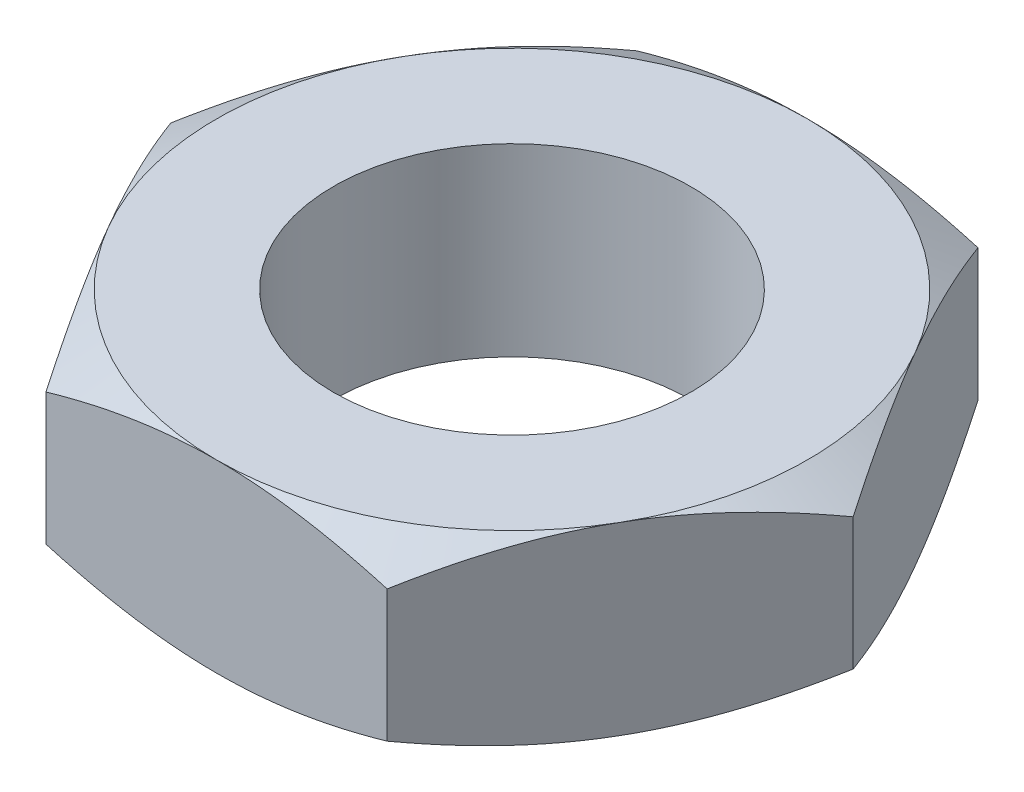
ISO-10303-21;
HEADER;
FILE_DESCRIPTION(('STEP AP214'),'2;1');
FILE_NAME('part.step','',(''),(''),'','','');
FILE_SCHEMA(('AUTOMOTIVE_DESIGN { 1 0 10303 214 1 1 1 1 }'));
ENDSEC;
DATA;
#1=APPLICATION_CONTEXT('core data for automotive mechanical design processes');
#2=APPLICATION_PROTOCOL_DEFINITION('international standard','automotive_design',2000,#1);
#3=PRODUCT_CONTEXT('',#1,'mechanical');
#4=PRODUCT('Part','Part','',(#3));
#5=PRODUCT_RELATED_PRODUCT_CATEGORY('part','',(#4));
#6=PRODUCT_DEFINITION_FORMATION('','',#4);
#7=PRODUCT_DEFINITION_CONTEXT('part definition',#1,'design');
#8=PRODUCT_DEFINITION('design','',#6,#7);
#9=PRODUCT_DEFINITION_SHAPE('','',#8);
#10=(LENGTH_UNIT() NAMED_UNIT(*) SI_UNIT(.MILLI.,.METRE.));
#11=(NAMED_UNIT(*) PLANE_ANGLE_UNIT() SI_UNIT($,.RADIAN.));
#12=(NAMED_UNIT(*) SI_UNIT($,.STERADIAN.) SOLID_ANGLE_UNIT());
#13=UNCERTAINTY_MEASURE_WITH_UNIT(LENGTH_MEASURE(1.E-05),#10,'distance_accuracy_value','');
#14=(GEOMETRIC_REPRESENTATION_CONTEXT(3) GLOBAL_UNCERTAINTY_ASSIGNED_CONTEXT((#13)) GLOBAL_UNIT_ASSIGNED_CONTEXT((#10,
#11,#12)) REPRESENTATION_CONTEXT('',''));
#15=CARTESIAN_POINT('',(0.,0.,0.));
#16=DIRECTION('',(0.,0.,1.));
#17=DIRECTION('',(1.,0.,0.));
#18=AXIS2_PLACEMENT_3D('',#15,#16,#17);
#19=CARTESIAN_POINT('',(-6.92820323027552,7.5,12.));
#20=DIRECTION('',(0.,0.,-1.));
#21=DIRECTION('',(-1.,0.,0.));
#22=AXIS2_PLACEMENT_3D('',#19,#20,#21);
#23=PLANE('',#22);
#24=CARTESIAN_POINT('',(-18.7486943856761,5.92369080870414,12.));
#25=CARTESIAN_POINT('',(-18.4860188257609,5.79596053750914,12.));
#26=CARTESIAN_POINT('',(-18.2230387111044,5.66885687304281,12.));
#27=CARTESIAN_POINT('',(-17.6964058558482,5.41604442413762,12.));
#28=CARTESIAN_POINT('',(-17.4327531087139,5.29033565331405,12.));
#29=CARTESIAN_POINT('',(-16.6406222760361,4.91548191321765,12.));
#30=CARTESIAN_POINT('',(-16.1110472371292,4.66864639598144,12.));
#31=CARTESIAN_POINT('',(-15.0455833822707,4.18130182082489,12.));
#32=CARTESIAN_POINT('',(-14.5096759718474,3.94083331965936,12.));
#33=CARTESIAN_POINT('',(-13.4336467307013,3.46955188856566,12.));
#34=CARTESIAN_POINT('',(-12.893525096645,3.23873851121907,12.));
#35=CARTESIAN_POINT('',(-11.7903970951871,2.78194278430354,12.));
#36=CARTESIAN_POINT('',(-11.227221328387,2.55636742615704,12.));
#37=CARTESIAN_POINT('',(-10.0943289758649,2.1219548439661,12.));
#38=CARTESIAN_POINT('',(-9.52461167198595,1.91311947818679,12.));
#39=CARTESIAN_POINT('',(-8.37876957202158,1.5175700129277,12.));
#40=CARTESIAN_POINT('',(-7.8026599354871,1.33081234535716,12.));
#41=CARTESIAN_POINT('',(-6.64212444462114,0.985307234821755,12.));
#42=CARTESIAN_POINT('',(-6.05770122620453,0.826551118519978,12.));
#43=CARTESIAN_POINT('',(-5.17630253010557,0.615519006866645,12.));
#44=CARTESIAN_POINT('',(-4.88251878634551,0.549834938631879,12.));
#45=CARTESIAN_POINT('',(-4.29291850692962,0.428275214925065,12.));
#46=CARTESIAN_POINT('',(-3.99710201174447,0.372399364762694,12.));
#47=CARTESIAN_POINT('',(-3.403631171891,0.271433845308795,12.));
#48=CARTESIAN_POINT('',(-3.10597686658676,0.226343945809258,12.));
#49=CARTESIAN_POINT('',(-2.5091332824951,0.147844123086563,12.));
#50=CARTESIAN_POINT('',(-2.20994406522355,0.114433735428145,12.));
#51=CARTESIAN_POINT('',(-1.61441788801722,0.0603836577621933,12.));
#52=CARTESIAN_POINT('',(-1.31809589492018,0.0395800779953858,12.));
#53=CARTESIAN_POINT('',(-0.72483783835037,0.0105296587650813,12.));
#54=CARTESIAN_POINT('',(-0.427901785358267,0.00228260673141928,12.));
#55=CARTESIAN_POINT('',(0.166055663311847,-0.00145794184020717,12.));
#56=CARTESIAN_POINT('',(0.463077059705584,0.00304867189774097,12.));
#57=CARTESIAN_POINT('',(1.05666188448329,0.0247037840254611,12.));
#58=CARTESIAN_POINT('',(1.35322529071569,0.0418528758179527,12.));
#59=CARTESIAN_POINT('',(2.06166094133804,0.0975529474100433,12.));
#60=CARTESIAN_POINT('',(2.47309030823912,0.141863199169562,12.));
#61=CARTESIAN_POINT('',(3.29296767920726,0.252431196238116,12.));
#62=CARTESIAN_POINT('',(3.70141528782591,0.318691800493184,12.));
#63=CARTESIAN_POINT('',(4.92176640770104,0.546891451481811,12.));
#64=CARTESIAN_POINT('',(5.72825274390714,0.738210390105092,12.));
#65=CARTESIAN_POINT('',(6.934617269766,1.07096510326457,12.));
#66=CARTESIAN_POINT('',(7.34072208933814,1.19113269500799,12.));
#67=CARTESIAN_POINT('',(8.14898832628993,1.44418734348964,12.));
#68=CARTESIAN_POINT('',(8.55114971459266,1.57707449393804,12.));
#69=CARTESIAN_POINT('',(9.35165499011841,1.85341597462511,12.));
#70=CARTESIAN_POINT('',(9.74999999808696,1.9968670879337,12.));
#71=CARTESIAN_POINT('',(10.5433695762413,2.29262450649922,12.));
#72=CARTESIAN_POINT('',(10.9383942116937,2.44493063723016,12.));
#73=CARTESIAN_POINT('',(11.968820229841,2.85337313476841,12.));
#74=CARTESIAN_POINT('',(12.6018490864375,3.11548815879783,12.));
#75=CARTESIAN_POINT('',(13.8616943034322,3.65429527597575,12.));
#76=CARTESIAN_POINT('',(14.48851006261,3.93098876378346,12.));
#77=CARTESIAN_POINT('',(15.7372917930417,4.49562594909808,12.));
#78=CARTESIAN_POINT('',(16.359256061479,4.78357340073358,12.));
#79=CARTESIAN_POINT('',(17.5990634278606,5.36812614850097,12.));
#80=CARTESIAN_POINT('',(18.2169066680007,5.66473114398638,12.));
#81=CARTESIAN_POINT('',(19.4501572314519,6.26521345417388,12.));
#82=CARTESIAN_POINT('',(20.0655596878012,6.56910074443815,12.));
#83=CARTESIAN_POINT('',(21.2936284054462,7.1823566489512,12.));
#84=CARTESIAN_POINT('',(21.906294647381,7.49172530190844,12.));
#85=CARTESIAN_POINT('',(23.1292475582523,8.11483969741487,12.));
#86=CARTESIAN_POINT('',(23.7395346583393,8.42858459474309,12.));
#87=CARTESIAN_POINT('',(24.9582204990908,9.05971268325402,12.));
#88=CARTESIAN_POINT('',(25.5666192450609,9.37709586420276,12.));
#89=CARTESIAN_POINT('',(27.2676771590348,10.2698366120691,12.));
#90=CARTESIAN_POINT('',(28.358573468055,10.8485526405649,12.));
#91=CARTESIAN_POINT('',(30.5366336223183,12.0130901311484,12.));
#92=CARTESIAN_POINT('',(31.623797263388,12.5989119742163,12.));
#93=CARTESIAN_POINT('',(33.7918654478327,13.7740610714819,12.));
#94=CARTESIAN_POINT('',(34.8727789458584,14.3633718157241,12.));
#95=CARTESIAN_POINT('',(36.492431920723,15.2503791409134,12.));
#96=CARTESIAN_POINT('',(37.0320110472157,15.5465446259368,12.));
#97=CARTESIAN_POINT('',(38.1106685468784,16.1397845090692,12.));
#98=CARTESIAN_POINT('',(38.6497469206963,16.4368589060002,12.));
#99=CARTESIAN_POINT('',(39.1886050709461,16.7343323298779,12.));
#100=B_SPLINE_CURVE_WITH_KNOTS('',3,(#24,#25,#26,#27,#28,#29,#30,#31,#32,#33,#34,#35,#36,#37,
#38,#39,#40,#41,#42,#43,#44,#45,#46,#47,#48,#49,#50,#51,#52,#53,#54,#55,#56,#57,#58,#59,#60,#61,
#62,#63,#64,#65,#66,#67,#68,#69,#70,#71,#72,#73,#74,#75,#76,#77,#78,#79,#80,#81,#82,#83,#84,#85,
#86,#87,#88,#89,#90,#91,#92,#93,#94,#95,#96,#97,#98,#99),.UNSPECIFIED.,.F.,.F.,(4,2,2,2,2,2,2,2,
2,2,2,2,2,2,2,2,2,2,2,2,2,2,2,2,2,2,2,2,2,2,2,2,2,2,2,2,2,4),(0.,0.876252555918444,
1.75251365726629,3.50528829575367,5.26737084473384,7.02937164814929,8.84918508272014,
10.6692002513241,12.4855616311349,14.3013594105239,15.2043332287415,16.1072891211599,
17.0102257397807,17.9131264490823,18.8040224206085,19.6949033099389,20.5857919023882,
21.4767223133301,22.7174501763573,23.9583397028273,26.4413944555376,27.711816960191,
28.9822488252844,30.2522954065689,31.522316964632,33.5774984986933,35.6328770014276,
37.6889470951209,39.7449458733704,41.8039432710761,43.8629552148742,45.9215748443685,
47.9801886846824,51.6848346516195,55.389680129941,59.0830336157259,60.9295802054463,
62.7761244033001),.UNSPECIFIED.);
#101=CARTESIAN_POINT('',(6.9282032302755,1.07179676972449,12.));
#102=VERTEX_POINT('',#101);
#103=CARTESIAN_POINT('',(0.,0.,12.));
#104=VERTEX_POINT('',#103);
#105=EDGE_CURVE('E140',#102,#104,#100,.F.);
#106=ORIENTED_EDGE('',*,*,#105,.F.);
#107=DIRECTION('',(0.,-1.,0.));
#108=VECTOR('',#107,1.);
#109=CARTESIAN_POINT('',(6.9282032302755,7.5,12.));
#110=LINE('',#109,#108);
#111=CARTESIAN_POINT('',(6.9282032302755,6.42820323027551,12.));
#112=VERTEX_POINT('',#111);
#113=EDGE_CURVE('E334',#112,#102,#110,.T.);
#114=ORIENTED_EDGE('',*,*,#113,.F.);
#115=CARTESIAN_POINT('',(-18.7486943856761,1.57630919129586,12.));
#116=CARTESIAN_POINT('',(-18.4860188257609,1.70403946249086,12.));
#117=CARTESIAN_POINT('',(-18.2230387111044,1.83114312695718,12.));
#118=CARTESIAN_POINT('',(-17.6964058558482,2.08395557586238,12.));
#119=CARTESIAN_POINT('',(-17.4327531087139,2.20966434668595,12.));
#120=CARTESIAN_POINT('',(-16.6406222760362,2.58451808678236,12.));
#121=CARTESIAN_POINT('',(-16.1110472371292,2.83135360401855,12.));
#122=CARTESIAN_POINT('',(-15.0455833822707,3.3186981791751,12.));
#123=CARTESIAN_POINT('',(-14.5096759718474,3.55916668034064,12.));
#124=CARTESIAN_POINT('',(-13.4336467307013,4.03044811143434,12.));
#125=CARTESIAN_POINT('',(-12.893525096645,4.26126148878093,12.));
#126=CARTESIAN_POINT('',(-11.7903970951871,4.71805721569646,12.));
#127=CARTESIAN_POINT('',(-11.227221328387,4.94363257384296,12.));
#128=CARTESIAN_POINT('',(-10.0943289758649,5.3780451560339,12.));
#129=CARTESIAN_POINT('',(-9.52461167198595,5.58688052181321,12.));
#130=CARTESIAN_POINT('',(-8.37876957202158,5.9824299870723,12.));
#131=CARTESIAN_POINT('',(-7.8026599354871,6.16918765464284,12.));
#132=CARTESIAN_POINT('',(-6.64212444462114,6.51469276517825,12.));
#133=CARTESIAN_POINT('',(-6.05770122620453,6.67344888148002,12.));
#134=CARTESIAN_POINT('',(-5.17630253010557,6.88448099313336,12.));
#135=CARTESIAN_POINT('',(-4.8825187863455,6.95016506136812,12.));
#136=CARTESIAN_POINT('',(-4.29291850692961,7.07172478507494,12.));
#137=CARTESIAN_POINT('',(-3.99710201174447,7.12760063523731,12.));
#138=CARTESIAN_POINT('',(-3.403631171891,7.22856615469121,12.));
#139=CARTESIAN_POINT('',(-3.10597686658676,7.27365605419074,12.));
#140=CARTESIAN_POINT('',(-2.5091332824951,7.35215587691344,12.));
#141=CARTESIAN_POINT('',(-2.20994406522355,7.38556626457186,12.));
#142=CARTESIAN_POINT('',(-1.61441788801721,7.43961634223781,12.));
#143=CARTESIAN_POINT('',(-1.31809589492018,7.46041992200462,12.));
#144=CARTESIAN_POINT('',(-0.724837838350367,7.48947034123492,12.));
#145=CARTESIAN_POINT('',(-0.427901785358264,7.49771739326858,12.));
#146=CARTESIAN_POINT('',(0.16605566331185,7.50145794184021,12.));
#147=CARTESIAN_POINT('',(0.463077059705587,7.49695132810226,12.));
#148=CARTESIAN_POINT('',(1.05666188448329,7.47529621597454,12.));
#149=CARTESIAN_POINT('',(1.35322529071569,7.45814712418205,12.));
#150=CARTESIAN_POINT('',(2.06166094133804,7.40244705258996,12.));
#151=CARTESIAN_POINT('',(2.47309030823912,7.35813680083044,12.));
#152=CARTESIAN_POINT('',(3.29296767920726,7.24756880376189,12.));
#153=CARTESIAN_POINT('',(3.70141528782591,7.18130819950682,12.));
#154=CARTESIAN_POINT('',(4.92176640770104,6.95310854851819,12.));
#155=CARTESIAN_POINT('',(5.72825274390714,6.76178960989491,12.));
#156=CARTESIAN_POINT('',(6.934617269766,6.42903489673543,12.));
#157=CARTESIAN_POINT('',(7.34072208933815,6.30886730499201,12.));
#158=CARTESIAN_POINT('',(8.14898832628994,6.05581265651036,12.));
#159=CARTESIAN_POINT('',(8.55114971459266,5.92292550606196,12.));
#160=CARTESIAN_POINT('',(9.35165499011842,5.64658402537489,12.));
#161=CARTESIAN_POINT('',(9.74999999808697,5.5031329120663,12.));
#162=CARTESIAN_POINT('',(10.5433695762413,5.20737549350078,12.));
#163=CARTESIAN_POINT('',(10.9383942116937,5.05506936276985,12.));
#164=CARTESIAN_POINT('',(11.968820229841,4.64662686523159,12.));
#165=CARTESIAN_POINT('',(12.6018490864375,4.38451184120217,12.));
#166=CARTESIAN_POINT('',(13.8616943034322,3.84570472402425,12.));
#167=CARTESIAN_POINT('',(14.48851006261,3.56901123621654,12.));
#168=CARTESIAN_POINT('',(15.7372917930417,3.00437405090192,12.));
#169=CARTESIAN_POINT('',(16.359256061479,2.71642659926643,12.));
#170=CARTESIAN_POINT('',(17.5990634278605,2.13187385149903,12.));
#171=CARTESIAN_POINT('',(18.2169066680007,1.83526885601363,12.));
#172=CARTESIAN_POINT('',(19.4501572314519,1.23478654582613,12.));
#173=CARTESIAN_POINT('',(20.0655596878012,0.930899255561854,12.));
#174=CARTESIAN_POINT('',(21.2936284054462,0.317643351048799,12.));
#175=CARTESIAN_POINT('',(21.906294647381,0.00827469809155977,12.));
#176=CARTESIAN_POINT('',(23.1292475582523,-0.614839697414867,12.));
#177=CARTESIAN_POINT('',(23.7395346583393,-0.928584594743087,12.));
#178=CARTESIAN_POINT('',(24.9582204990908,-1.55971268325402,12.));
#179=CARTESIAN_POINT('',(25.5666192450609,-1.87709586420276,12.));
#180=CARTESIAN_POINT('',(27.2676771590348,-2.76983661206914,12.));
#181=CARTESIAN_POINT('',(28.358573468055,-3.34855264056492,12.));
#182=CARTESIAN_POINT('',(30.5366336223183,-4.51309013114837,12.));
#183=CARTESIAN_POINT('',(31.623797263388,-5.09891197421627,12.));
#184=CARTESIAN_POINT('',(33.7918654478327,-6.27406107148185,12.));
#185=CARTESIAN_POINT('',(34.8727789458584,-6.86337181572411,12.));
#186=CARTESIAN_POINT('',(36.492431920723,-7.75037914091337,12.));
#187=CARTESIAN_POINT('',(37.0320110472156,-8.04654462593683,12.));
#188=CARTESIAN_POINT('',(38.1106685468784,-8.63978450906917,12.));
#189=CARTESIAN_POINT('',(38.6497469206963,-8.93685890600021,12.));
#190=CARTESIAN_POINT('',(39.1886050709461,-9.2343323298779,12.));
#191=B_SPLINE_CURVE_WITH_KNOTS('',3,(#115,#116,#117,#118,#119,#120,#121,#122,#123,#124,#125,
#126,#127,#128,#129,#130,#131,#132,#133,#134,#135,#136,#137,#138,#139,#140,#141,#142,#143,#144,
#145,#146,#147,#148,#149,#150,#151,#152,#153,#154,#155,#156,#157,#158,#159,#160,#161,#162,#163,
#164,#165,#166,#167,#168,#169,#170,#171,#172,#173,#174,#175,#176,#177,#178,#179,#180,#181,#182,
#183,#184,#185,#186,#187,#188,#189,#190),.UNSPECIFIED.,.F.,.F.,(4,2,2,2,2,2,2,2,2,2,2,2,2,2,2,2,
2,2,2,2,2,2,2,2,2,2,2,2,2,2,2,2,2,2,2,2,2,4),(0.,0.87625255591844,1.75251365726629,
3.50528829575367,5.26737084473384,7.02937164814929,8.84918508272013,10.6692002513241,
12.4855616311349,14.3013594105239,15.2043332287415,16.1072891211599,17.0102257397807,
17.9131264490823,18.8040224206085,19.6949033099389,20.5857919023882,21.4767223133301,
22.7174501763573,23.9583397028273,26.4413944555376,27.711816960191,28.9822488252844,
30.2522954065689,31.522316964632,33.5774984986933,35.6328770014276,37.6889470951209,
39.7449458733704,41.8039432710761,43.8629552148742,45.9215748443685,47.9801886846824,
51.6848346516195,55.389680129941,59.0830336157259,60.9295802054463,62.7761244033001),.UNSPECIFIED.);
#192=CARTESIAN_POINT('',(0.,7.5,12.));
#193=VERTEX_POINT('',#192);
#194=EDGE_CURVE('E302',#193,#112,#191,.T.);
#195=ORIENTED_EDGE('',*,*,#194,.F.);
#196=CARTESIAN_POINT('',(-6.92820323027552,6.42820323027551,12.));
#197=VERTEX_POINT('',#196);
#198=EDGE_CURVE('E339',#197,#193,#191,.T.);
#199=ORIENTED_EDGE('',*,*,#198,.F.);
#200=DIRECTION('',(0.,-1.,0.));
#201=VECTOR('',#200,1.);
#202=CARTESIAN_POINT('',(-6.92820323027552,7.5,12.));
#203=LINE('',#202,#201);
#204=CARTESIAN_POINT('',(-6.92820323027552,1.07179676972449,12.));
#205=VERTEX_POINT('',#204);
#206=EDGE_CURVE('E169',#197,#205,#203,.T.);
#207=ORIENTED_EDGE('',*,*,#206,.T.);
#208=EDGE_CURVE('E152',#104,#205,#100,.F.);
#209=ORIENTED_EDGE('',*,*,#208,.F.);
#210=EDGE_LOOP('',(#106,#114,#195,#199,#207,#209));
#211=FACE_BOUND('',#210,.T.);
#212=ADVANCED_FACE('F51',(#211),#23,.F.);
#213=CARTESIAN_POINT('',(6.9282032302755,7.5,12.));
#214=DIRECTION('',(-0.866025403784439,0.,-0.5));
#215=DIRECTION('',(-0.5,0.,0.866025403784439));
#216=AXIS2_PLACEMENT_3D('',#213,#214,#215);
#217=PLANE('',#216);
#218=CARTESIAN_POINT('',(13.8565219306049,1.07186343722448,-0.000199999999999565));
#219=CARTESIAN_POINT('',(13.7042251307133,0.983949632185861,0.263585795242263));
#220=CARTESIAN_POINT('',(13.5513604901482,0.900025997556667,0.5283551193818));
#221=CARTESIAN_POINT('',(13.244405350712,0.741266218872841,1.06001701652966));
#222=CARTESIAN_POINT('',(13.0903144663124,0.666433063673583,1.32691025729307));
#223=CARTESIAN_POINT('',(12.6255589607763,0.457017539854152,2.13189040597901));
#224=CARTESIAN_POINT('',(12.3130596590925,0.33790323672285,2.6731550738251));
#225=CARTESIAN_POINT('',(11.8454187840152,0.198231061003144,3.483132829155));
#226=CARTESIAN_POINT('',(11.6916742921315,0.158443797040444,3.74942610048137));
#227=CARTESIAN_POINT('',(11.3834734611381,0.0917233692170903,4.28324559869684));
#228=CARTESIAN_POINT('',(11.2290171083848,0.0647904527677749,4.55077184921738));
#229=CARTESIAN_POINT('',(10.9198468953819,0.0244685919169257,5.08627036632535));
#230=CARTESIAN_POINT('',(10.7651335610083,0.0110635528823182,5.35424172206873));
#231=CARTESIAN_POINT('',(10.4555635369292,-0.00191690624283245,5.89043273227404));
#232=CARTESIAN_POINT('',(10.3007068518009,-0.00149275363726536,6.15865237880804));
#233=CARTESIAN_POINT('',(10.011202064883,0.0122200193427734,6.66008937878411));
#234=CARTESIAN_POINT('',(9.87653331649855,0.0238359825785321,6.89334249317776));
#235=CARTESIAN_POINT('',(9.60750555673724,0.0573080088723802,7.35931224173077));
#236=CARTESIAN_POINT('',(9.47314656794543,0.0791647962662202,7.59202883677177));
#237=CARTESIAN_POINT('',(9.20481134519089,0.132737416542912,8.05679907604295));
#238=CARTESIAN_POINT('',(9.07083551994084,0.164461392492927,8.28885201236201));
#239=CARTESIAN_POINT('',(8.80351197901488,0.237211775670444,8.75186996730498));
#240=CARTESIAN_POINT('',(8.67016430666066,0.278238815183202,8.98283491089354));
#241=CARTESIAN_POINT('',(8.2653799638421,0.416311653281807,9.68394195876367));
#242=CARTESIAN_POINT('',(7.99511549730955,0.52712488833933,10.1520537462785));
#243=CARTESIAN_POINT('',(7.45861659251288,0.778625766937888,11.0812971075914));
#244=CARTESIAN_POINT('',(7.19237528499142,0.919254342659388,11.5424405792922));
#245=CARTESIAN_POINT('',(6.92808776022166,1.07186343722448,12.0002));
#246=B_SPLINE_CURVE_WITH_KNOTS('',3,(#218,#219,#220,#221,#222,#223,#224,#225,#226,#227,#228,
#229,#230,#231,#232,#233,#234,#235,#236,#237,#238,#239,#240,#241,#242,#243,#244,#245),
.UNSPECIFIED.,.F.,.F.,(4,2,2,2,2,2,2,2,2,2,2,2,2,4),(0.,0.951004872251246,1.90232158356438,
3.80900466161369,4.7389455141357,5.66890426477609,6.59775529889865,7.5265776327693,
8.33514643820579,9.1437724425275,9.95306755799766,10.7624176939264,12.4167102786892,
14.0677556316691),.UNSPECIFIED.);
#247=CARTESIAN_POINT('',(13.856406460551,1.07179676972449,0.));
#248=VERTEX_POINT('',#247);
#249=CARTESIAN_POINT('',(10.3923048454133,0.,6.));
#250=VERTEX_POINT('',#249);
#251=EDGE_CURVE('E67',#248,#250,#246,.T.);
#252=ORIENTED_EDGE('',*,*,#251,.F.);
#253=DIRECTION('',(0.,-1.,0.));
#254=VECTOR('',#253,1.);
#255=CARTESIAN_POINT('',(13.856406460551,7.5,0.));
#256=LINE('',#255,#254);
#257=CARTESIAN_POINT('',(13.856406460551,6.42820323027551,0.));
#258=VERTEX_POINT('',#257);
#259=EDGE_CURVE('E298',#258,#248,#256,.T.);
#260=ORIENTED_EDGE('',*,*,#259,.F.);
#261=CARTESIAN_POINT('',(6.92808776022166,6.42813656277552,12.0002));
#262=CARTESIAN_POINT('',(7.08038456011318,6.51605036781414,11.7364142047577));
#263=CARTESIAN_POINT('',(7.2332492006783,6.59997400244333,11.4716448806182));
#264=CARTESIAN_POINT('',(7.54020434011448,6.75873378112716,10.9399829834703));
#265=CARTESIAN_POINT('',(7.69429522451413,6.83356693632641,10.6730897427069));
#266=CARTESIAN_POINT('',(8.15905073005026,7.04298246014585,9.86810959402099));
#267=CARTESIAN_POINT('',(8.47155003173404,7.16209676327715,9.3268449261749));
#268=CARTESIAN_POINT('',(8.93919090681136,7.30176893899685,8.51686717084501));
#269=CARTESIAN_POINT('',(9.09293539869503,7.34155620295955,8.25057389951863));
#270=CARTESIAN_POINT('',(9.4011362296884,7.40827663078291,7.71675440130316));
#271=CARTESIAN_POINT('',(9.55559258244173,7.43520954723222,7.44922815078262));
#272=CARTESIAN_POINT('',(9.86476279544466,7.47553140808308,6.91372963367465));
#273=CARTESIAN_POINT('',(10.0194761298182,7.48893644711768,6.64575827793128));
#274=CARTESIAN_POINT('',(10.3290461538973,7.50191690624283,6.10956726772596));
#275=CARTESIAN_POINT('',(10.4839028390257,7.50149275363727,5.84134762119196));
#276=CARTESIAN_POINT('',(10.7734076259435,7.48777998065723,5.3399106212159));
#277=CARTESIAN_POINT('',(10.908076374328,7.47616401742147,5.10665750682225));
#278=CARTESIAN_POINT('',(11.1771041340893,7.44269199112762,4.64068775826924));
#279=CARTESIAN_POINT('',(11.3114631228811,7.42083520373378,4.40797116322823));
#280=CARTESIAN_POINT('',(11.5797983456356,7.36726258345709,3.94320092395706));
#281=CARTESIAN_POINT('',(11.7137741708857,7.33553860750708,3.711147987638));
#282=CARTESIAN_POINT('',(11.9810977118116,7.26278822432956,3.24813003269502));
#283=CARTESIAN_POINT('',(12.1144453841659,7.2217611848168,3.01716508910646));
#284=CARTESIAN_POINT('',(12.5192297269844,7.0836883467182,2.31605804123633));
#285=CARTESIAN_POINT('',(12.789494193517,6.97287511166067,1.84794625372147));
#286=CARTESIAN_POINT('',(13.3259930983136,6.72137423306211,0.918702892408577));
#287=CARTESIAN_POINT('',(13.5922344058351,6.58074565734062,0.457559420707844));
#288=CARTESIAN_POINT('',(13.8565219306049,6.42813656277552,-0.000200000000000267));
#289=B_SPLINE_CURVE_WITH_KNOTS('',3,(#261,#262,#263,#264,#265,#266,#267,#268,#269,#270,#271,
#272,#273,#274,#275,#276,#277,#278,#279,#280,#281,#282,#283,#284,#285,#286,#287,#288),
.UNSPECIFIED.,.F.,.F.,(4,2,2,2,2,2,2,2,2,2,2,2,2,4),(0.,0.951004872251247,1.90232158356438,
3.80900466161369,4.73894551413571,5.6689042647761,6.59775529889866,7.52657763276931,
8.33514643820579,9.1437724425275,9.95306755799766,10.7624176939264,12.4167102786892,
14.0677556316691),.UNSPECIFIED.);
#290=CARTESIAN_POINT('',(10.3923048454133,7.5,6.));
#291=VERTEX_POINT('',#290);
#292=EDGE_CURVE('E266',#291,#258,#289,.T.);
#293=ORIENTED_EDGE('',*,*,#292,.F.);
#294=EDGE_CURVE('E296',#112,#291,#289,.T.);
#295=ORIENTED_EDGE('',*,*,#294,.F.);
#296=ORIENTED_EDGE('',*,*,#113,.T.);
#297=EDGE_CURVE('E146',#250,#102,#246,.T.);
#298=ORIENTED_EDGE('',*,*,#297,.F.);
#299=EDGE_LOOP('',(#252,#260,#293,#295,#296,#298));
#300=FACE_BOUND('',#299,.T.);
#301=ADVANCED_FACE('F259',(#300),#217,.F.);
#302=CARTESIAN_POINT('',(13.856406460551,7.5,0.));
#303=DIRECTION('',(-0.866025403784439,0.,0.5));
#304=DIRECTION('',(0.5,0.,0.866025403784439));
#305=AXIS2_PLACEMENT_3D('',#302,#303,#304);
#306=PLANE('',#305);
#307=CARTESIAN_POINT('',(6.92808776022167,1.07186343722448,-12.0002));
#308=CARTESIAN_POINT('',(7.08038456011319,0.983949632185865,-11.7364142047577));
#309=CARTESIAN_POINT('',(7.23324920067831,0.900025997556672,-11.4716448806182));
#310=CARTESIAN_POINT('',(7.54020434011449,0.741266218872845,-10.9399829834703));
#311=CARTESIAN_POINT('',(7.69429522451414,0.666433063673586,-10.6730897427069));
#312=CARTESIAN_POINT('',(8.15905073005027,0.457017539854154,-9.86810959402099));
#313=CARTESIAN_POINT('',(8.47155003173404,0.337903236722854,-9.3268449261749));
#314=CARTESIAN_POINT('',(8.93919090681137,0.198231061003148,-8.516867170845));
#315=CARTESIAN_POINT('',(9.09293539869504,0.158443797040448,-8.25057389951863));
#316=CARTESIAN_POINT('',(9.40113622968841,0.0917233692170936,-7.71675440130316));
#317=CARTESIAN_POINT('',(9.55559258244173,0.0647904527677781,-7.44922815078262));
#318=CARTESIAN_POINT('',(9.86476279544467,0.024468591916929,-6.91372963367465));
#319=CARTESIAN_POINT('',(10.0194761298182,0.0110635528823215,-6.64575827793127));
#320=CARTESIAN_POINT('',(10.3290461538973,-0.00191690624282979,-6.10956726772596));
#321=CARTESIAN_POINT('',(10.4839028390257,-0.00149275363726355,-5.84134762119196));
#322=CARTESIAN_POINT('',(10.7734076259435,0.0122200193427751,-5.33991062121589));
#323=CARTESIAN_POINT('',(10.908076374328,0.0238359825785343,-5.10665750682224));
#324=CARTESIAN_POINT('',(11.1771041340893,0.0573080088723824,-4.64068775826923));
#325=CARTESIAN_POINT('',(11.3114631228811,0.0791647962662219,-4.40797116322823));
#326=CARTESIAN_POINT('',(11.5797983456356,0.132737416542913,-3.94320092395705));
#327=CARTESIAN_POINT('',(11.7137741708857,0.164461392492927,-3.71114798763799));
#328=CARTESIAN_POINT('',(11.9810977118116,0.237211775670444,-3.24813003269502));
#329=CARTESIAN_POINT('',(12.1144453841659,0.278238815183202,-3.01716508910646));
#330=CARTESIAN_POINT('',(12.5192297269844,0.416311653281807,-2.31605804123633));
#331=CARTESIAN_POINT('',(12.789494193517,0.52712488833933,-1.84794625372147));
#332=CARTESIAN_POINT('',(13.3259930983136,0.778625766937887,-0.918702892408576));
#333=CARTESIAN_POINT('',(13.5922344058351,0.919254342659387,-0.457559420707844));
#334=CARTESIAN_POINT('',(13.8565219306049,1.07186343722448,0.000199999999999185));
#335=B_SPLINE_CURVE_WITH_KNOTS('',3,(#307,#308,#309,#310,#311,#312,#313,#314,#315,#316,#317,
#318,#319,#320,#321,#322,#323,#324,#325,#326,#327,#328,#329,#330,#331,#332,#333,#334),
.UNSPECIFIED.,.F.,.F.,(4,2,2,2,2,2,2,2,2,2,2,2,2,4),(0.,0.951004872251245,1.90232158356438,
3.80900466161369,4.7389455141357,5.66890426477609,6.59775529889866,7.52657763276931,
8.33514643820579,9.14377244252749,9.95306755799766,10.7624176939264,12.4167102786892,
14.0677556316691),.UNSPECIFIED.);
#336=CARTESIAN_POINT('',(6.92820323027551,1.07179676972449,-12.));
#337=VERTEX_POINT('',#336);
#338=CARTESIAN_POINT('',(10.3923048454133,0.,-5.99999999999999));
#339=VERTEX_POINT('',#338);
#340=EDGE_CURVE('E74',#337,#339,#335,.T.);
#341=ORIENTED_EDGE('',*,*,#340,.F.);
#342=DIRECTION('',(0.,-1.,0.));
#343=VECTOR('',#342,1.);
#344=CARTESIAN_POINT('',(6.92820323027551,7.5,-12.));
#345=LINE('',#344,#343);
#346=CARTESIAN_POINT('',(6.92820323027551,6.42820323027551,-12.));
#347=VERTEX_POINT('',#346);
#348=EDGE_CURVE('E325',#347,#337,#345,.T.);
#349=ORIENTED_EDGE('',*,*,#348,.F.);
#350=CARTESIAN_POINT('',(13.8565219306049,6.42813656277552,0.000200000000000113));
#351=CARTESIAN_POINT('',(13.7042251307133,6.51605036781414,-0.263585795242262));
#352=CARTESIAN_POINT('',(13.5513604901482,6.59997400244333,-0.5283551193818));
#353=CARTESIAN_POINT('',(13.244405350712,6.75873378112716,-1.06001701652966));
#354=CARTESIAN_POINT('',(13.0903144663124,6.83356693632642,-1.32691025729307));
#355=CARTESIAN_POINT('',(12.6255589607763,7.04298246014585,-2.13189040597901));
#356=CARTESIAN_POINT('',(12.3130596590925,7.16209676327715,-2.6731550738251));
#357=CARTESIAN_POINT('',(11.8454187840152,7.30176893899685,-3.483132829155));
#358=CARTESIAN_POINT('',(11.6916742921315,7.34155620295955,-3.74942610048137));
#359=CARTESIAN_POINT('',(11.3834734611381,7.40827663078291,-4.28324559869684));
#360=CARTESIAN_POINT('',(11.2290171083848,7.43520954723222,-4.55077184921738));
#361=CARTESIAN_POINT('',(10.9198468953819,7.47553140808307,-5.08627036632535));
#362=CARTESIAN_POINT('',(10.7651335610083,7.48893644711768,-5.35424172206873));
#363=CARTESIAN_POINT('',(10.4555635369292,7.50191690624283,-5.89043273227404));
#364=CARTESIAN_POINT('',(10.3007068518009,7.50149275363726,-6.15865237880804));
#365=CARTESIAN_POINT('',(10.011202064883,7.48777998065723,-6.66008937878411));
#366=CARTESIAN_POINT('',(9.87653331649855,7.47616401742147,-6.89334249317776));
#367=CARTESIAN_POINT('',(9.60750555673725,7.44269199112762,-7.35931224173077));
#368=CARTESIAN_POINT('',(9.47314656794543,7.42083520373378,-7.59202883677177));
#369=CARTESIAN_POINT('',(9.2048113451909,7.36726258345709,-8.05679907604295));
#370=CARTESIAN_POINT('',(9.07083551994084,7.33553860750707,-8.288852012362));
#371=CARTESIAN_POINT('',(8.80351197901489,7.26278822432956,-8.75186996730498));
#372=CARTESIAN_POINT('',(8.67016430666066,7.2217611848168,-8.98283491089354));
#373=CARTESIAN_POINT('',(8.2653799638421,7.08368834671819,-9.68394195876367));
#374=CARTESIAN_POINT('',(7.99511549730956,6.97287511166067,-10.1520537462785));
#375=CARTESIAN_POINT('',(7.45861659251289,6.72137423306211,-11.0812971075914));
#376=CARTESIAN_POINT('',(7.19237528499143,6.58074565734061,-11.5424405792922));
#377=CARTESIAN_POINT('',(6.92808776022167,6.42813656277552,-12.0002));
#378=B_SPLINE_CURVE_WITH_KNOTS('',3,(#350,#351,#352,#353,#354,#355,#356,#357,#358,#359,#360,
#361,#362,#363,#364,#365,#366,#367,#368,#369,#370,#371,#372,#373,#374,#375,#376,#377),
.UNSPECIFIED.,.F.,.F.,(4,2,2,2,2,2,2,2,2,2,2,2,2,4),(0.,0.951004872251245,1.90232158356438,
3.80900466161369,4.7389455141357,5.66890426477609,6.59775529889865,7.5265776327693,
8.33514643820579,9.14377244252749,9.95306755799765,10.7624176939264,12.4167102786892,
14.0677556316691),.UNSPECIFIED.);
#379=CARTESIAN_POINT('',(10.3923048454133,7.5,-5.99999999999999));
#380=VERTEX_POINT('',#379);
#381=EDGE_CURVE('E246',#380,#347,#378,.T.);
#382=ORIENTED_EDGE('',*,*,#381,.F.);
#383=EDGE_CURVE('E301',#258,#380,#378,.T.);
#384=ORIENTED_EDGE('',*,*,#383,.F.);
#385=ORIENTED_EDGE('',*,*,#259,.T.);
#386=EDGE_CURVE('E201',#339,#248,#335,.T.);
#387=ORIENTED_EDGE('',*,*,#386,.F.);
#388=EDGE_LOOP('',(#341,#349,#382,#384,#385,#387));
#389=FACE_BOUND('',#388,.T.);
#390=ADVANCED_FACE('F254',(#389),#306,.F.);
#391=CARTESIAN_POINT('',(6.92820323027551,7.5,-12.));
#392=DIRECTION('',(0.,0.,1.));
#393=DIRECTION('',(1.,0.,0.));
#394=AXIS2_PLACEMENT_3D('',#391,#392,#393);
#395=PLANE('',#394);
#396=CARTESIAN_POINT('',(-18.7486943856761,5.92369080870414,-12.));
#397=CARTESIAN_POINT('',(-18.4860188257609,5.79596053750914,-12.));
#398=CARTESIAN_POINT('',(-18.2230387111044,5.66885687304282,-12.));
#399=CARTESIAN_POINT('',(-17.6964058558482,5.41604442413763,-12.));
#400=CARTESIAN_POINT('',(-17.4327531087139,5.29033565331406,-12.));
#401=CARTESIAN_POINT('',(-16.6406222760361,4.91548191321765,-12.));
#402=CARTESIAN_POINT('',(-16.1110472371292,4.66864639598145,-12.));
#403=CARTESIAN_POINT('',(-15.0455833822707,4.1813018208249,-12.));
#404=CARTESIAN_POINT('',(-14.5096759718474,3.94083331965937,-12.));
#405=CARTESIAN_POINT('',(-13.4336467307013,3.46955188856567,-12.));
#406=CARTESIAN_POINT('',(-12.893525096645,3.23873851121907,-12.));
#407=CARTESIAN_POINT('',(-11.7903970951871,2.78194278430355,-12.));
#408=CARTESIAN_POINT('',(-11.227221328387,2.55636742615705,-12.));
#409=CARTESIAN_POINT('',(-10.0943289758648,2.12195484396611,-12.));
#410=CARTESIAN_POINT('',(-9.52461167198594,1.9131194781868,-12.));
#411=CARTESIAN_POINT('',(-8.37876957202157,1.5175700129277,-12.));
#412=CARTESIAN_POINT('',(-7.80265993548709,1.33081234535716,-12.));
#413=CARTESIAN_POINT('',(-6.64212444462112,0.985307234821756,-12.));
#414=CARTESIAN_POINT('',(-6.05770122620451,0.826551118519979,-12.));
#415=CARTESIAN_POINT('',(-5.17630253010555,0.615519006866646,-12.));
#416=CARTESIAN_POINT('',(-4.88251878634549,0.54983493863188,-12.));
#417=CARTESIAN_POINT('',(-4.2929185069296,0.428275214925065,-12.));
#418=CARTESIAN_POINT('',(-3.99710201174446,0.372399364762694,-12.));
#419=CARTESIAN_POINT('',(-3.40363117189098,0.271433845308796,-12.));
#420=CARTESIAN_POINT('',(-3.10597686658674,0.226343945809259,-12.));
#421=CARTESIAN_POINT('',(-2.50913328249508,0.147844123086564,-12.));
#422=CARTESIAN_POINT('',(-2.20994406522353,0.114433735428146,-12.));
#423=CARTESIAN_POINT('',(-1.6144178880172,0.0603836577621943,-12.));
#424=CARTESIAN_POINT('',(-1.31809589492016,0.0395800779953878,-12.));
#425=CARTESIAN_POINT('',(-0.724837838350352,0.0105296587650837,-12.));
#426=CARTESIAN_POINT('',(-0.427901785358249,0.00228260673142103,-12.));
#427=CARTESIAN_POINT('',(0.166055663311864,-0.00145794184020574,-12.));
#428=CARTESIAN_POINT('',(0.463077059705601,0.00304867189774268,-12.));
#429=CARTESIAN_POINT('',(1.0566618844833,0.0247037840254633,-12.));
#430=CARTESIAN_POINT('',(1.35322529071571,0.0418528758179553,-12.));
#431=CARTESIAN_POINT('',(2.06166094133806,0.0975529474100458,-12.));
#432=CARTESIAN_POINT('',(2.47309030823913,0.141863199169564,-12.));
#433=CARTESIAN_POINT('',(3.29296767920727,0.252431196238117,-12.));
#434=CARTESIAN_POINT('',(3.70141528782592,0.318691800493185,-12.));
#435=CARTESIAN_POINT('',(4.92176640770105,0.546891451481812,-12.));
#436=CARTESIAN_POINT('',(5.72825274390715,0.738210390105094,-12.));
#437=CARTESIAN_POINT('',(6.93461726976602,1.07096510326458,-12.));
#438=CARTESIAN_POINT('',(7.34072208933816,1.19113269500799,-12.));
#439=CARTESIAN_POINT('',(8.14898832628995,1.44418734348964,-12.));
#440=CARTESIAN_POINT('',(8.55114971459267,1.57707449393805,-12.));
#441=CARTESIAN_POINT('',(9.35165499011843,1.85341597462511,-12.));
#442=CARTESIAN_POINT('',(9.74999999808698,1.9968670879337,-12.));
#443=CARTESIAN_POINT('',(10.5433695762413,2.29262450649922,-12.));
#444=CARTESIAN_POINT('',(10.9383942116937,2.44493063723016,-12.));
#445=CARTESIAN_POINT('',(11.9688202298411,2.85337313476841,-12.));
#446=CARTESIAN_POINT('',(12.6018490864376,3.11548815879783,-12.));
#447=CARTESIAN_POINT('',(13.8616943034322,3.65429527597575,-12.));
#448=CARTESIAN_POINT('',(14.48851006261,3.93098876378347,-12.));
#449=CARTESIAN_POINT('',(15.7372917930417,4.49562594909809,-12.));
#450=CARTESIAN_POINT('',(16.359256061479,4.78357340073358,-12.));
#451=CARTESIAN_POINT('',(17.5990634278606,5.36812614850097,-12.));
#452=CARTESIAN_POINT('',(18.2169066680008,5.66473114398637,-12.));
#453=CARTESIAN_POINT('',(19.4501572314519,6.26521345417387,-12.));
#454=CARTESIAN_POINT('',(20.0655596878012,6.56910074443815,-12.));
#455=CARTESIAN_POINT('',(21.2936284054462,7.1823566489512,-12.));
#456=CARTESIAN_POINT('',(21.906294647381,7.49172530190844,-12.));
#457=CARTESIAN_POINT('',(23.1292475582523,8.11483969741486,-12.));
#458=CARTESIAN_POINT('',(23.7395346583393,8.42858459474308,-12.));
#459=CARTESIAN_POINT('',(24.9582204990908,9.05971268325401,-12.));
#460=CARTESIAN_POINT('',(25.5666192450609,9.37709586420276,-12.));
#461=CARTESIAN_POINT('',(27.2676771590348,10.2698366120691,-12.));
#462=CARTESIAN_POINT('',(28.358573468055,10.8485526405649,-12.));
#463=CARTESIAN_POINT('',(30.5366336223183,12.0130901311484,-12.));
#464=CARTESIAN_POINT('',(31.623797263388,12.5989119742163,-12.));
#465=CARTESIAN_POINT('',(33.7918654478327,13.7740610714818,-12.));
#466=CARTESIAN_POINT('',(34.8727789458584,14.3633718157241,-12.));
#467=CARTESIAN_POINT('',(36.492431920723,15.2503791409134,-12.));
#468=CARTESIAN_POINT('',(37.0320110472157,15.5465446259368,-12.));
#469=CARTESIAN_POINT('',(38.1106685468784,16.1397845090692,-12.));
#470=CARTESIAN_POINT('',(38.6497469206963,16.4368589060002,-12.));
#471=CARTESIAN_POINT('',(39.1886050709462,16.7343323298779,-12.));
#472=B_SPLINE_CURVE_WITH_KNOTS('',3,(#396,#397,#398,#399,#400,#401,#402,#403,#404,#405,#406,
#407,#408,#409,#410,#411,#412,#413,#414,#415,#416,#417,#418,#419,#420,#421,#422,#423,#424,#425,
#426,#427,#428,#429,#430,#431,#432,#433,#434,#435,#436,#437,#438,#439,#440,#441,#442,#443,#444,
#445,#446,#447,#448,#449,#450,#451,#452,#453,#454,#455,#456,#457,#458,#459,#460,#461,#462,#463,
#464,#465,#466,#467,#468,#469,#470,#471),.UNSPECIFIED.,.F.,.F.,(4,2,2,2,2,2,2,2,2,2,2,2,2,2,2,2,
2,2,2,2,2,2,2,2,2,2,2,2,2,2,2,2,2,2,2,2,2,4),(0.,0.876252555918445,1.75251365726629,
3.50528829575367,5.26737084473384,7.02937164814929,8.84918508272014,10.6692002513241,
12.4855616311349,14.3013594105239,15.2043332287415,16.1072891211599,17.0102257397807,
17.9131264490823,18.8040224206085,19.6949033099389,20.5857919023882,21.4767223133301,
22.7174501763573,23.9583397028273,26.4413944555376,27.711816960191,28.9822488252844,
30.2522954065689,31.522316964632,33.5774984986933,35.6328770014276,37.6889470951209,
39.7449458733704,41.8039432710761,43.8629552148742,45.9215748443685,47.9801886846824,
51.6848346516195,55.389680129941,59.0830336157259,60.9295802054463,62.7761244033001),.UNSPECIFIED.);
#473=CARTESIAN_POINT('',(-6.92820323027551,1.07179676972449,-12.));
#474=VERTEX_POINT('',#473);
#475=CARTESIAN_POINT('',(0.,0.,-12.));
#476=VERTEX_POINT('',#475);
#477=EDGE_CURVE('E182',#474,#476,#472,.T.);
#478=ORIENTED_EDGE('',*,*,#477,.F.);
#479=DIRECTION('',(0.,-1.,0.));
#480=VECTOR('',#479,1.);
#481=CARTESIAN_POINT('',(-6.92820323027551,7.5,-12.));
#482=LINE('',#481,#480);
#483=CARTESIAN_POINT('',(-6.92820323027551,6.42820323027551,-12.));
#484=VERTEX_POINT('',#483);
#485=EDGE_CURVE('E322',#484,#474,#482,.T.);
#486=ORIENTED_EDGE('',*,*,#485,.F.);
#487=CARTESIAN_POINT('',(-18.7486943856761,1.57630919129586,-12.));
#488=CARTESIAN_POINT('',(-18.4860188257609,1.70403946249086,-12.));
#489=CARTESIAN_POINT('',(-18.2230387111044,1.83114312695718,-12.));
#490=CARTESIAN_POINT('',(-17.6964058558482,2.08395557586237,-12.));
#491=CARTESIAN_POINT('',(-17.4327531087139,2.20966434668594,-12.));
#492=CARTESIAN_POINT('',(-16.6406222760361,2.58451808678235,-12.));
#493=CARTESIAN_POINT('',(-16.1110472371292,2.83135360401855,-12.));
#494=CARTESIAN_POINT('',(-15.0455833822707,3.31869817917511,-12.));
#495=CARTESIAN_POINT('',(-14.5096759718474,3.55916668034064,-12.));
#496=CARTESIAN_POINT('',(-13.4336467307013,4.03044811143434,-12.));
#497=CARTESIAN_POINT('',(-12.893525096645,4.26126148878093,-12.));
#498=CARTESIAN_POINT('',(-11.7903970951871,4.71805721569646,-12.));
#499=CARTESIAN_POINT('',(-11.227221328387,4.94363257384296,-12.));
#500=CARTESIAN_POINT('',(-10.0943289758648,5.3780451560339,-12.));
#501=CARTESIAN_POINT('',(-9.52461167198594,5.58688052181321,-12.));
#502=CARTESIAN_POINT('',(-8.37876957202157,5.9824299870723,-12.));
#503=CARTESIAN_POINT('',(-7.80265993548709,6.16918765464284,-12.));
#504=CARTESIAN_POINT('',(-6.64212444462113,6.51469276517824,-12.));
#505=CARTESIAN_POINT('',(-6.05770122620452,6.67344888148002,-12.));
#506=CARTESIAN_POINT('',(-5.17630253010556,6.88448099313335,-12.));
#507=CARTESIAN_POINT('',(-4.88251878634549,6.95016506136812,-12.));
#508=CARTESIAN_POINT('',(-4.2929185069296,7.07172478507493,-12.));
#509=CARTESIAN_POINT('',(-3.99710201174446,7.1276006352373,-12.));
#510=CARTESIAN_POINT('',(-3.40363117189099,7.2285661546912,-12.));
#511=CARTESIAN_POINT('',(-3.10597686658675,7.27365605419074,-12.));
#512=CARTESIAN_POINT('',(-2.50913328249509,7.35215587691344,-12.));
#513=CARTESIAN_POINT('',(-2.20994406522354,7.38556626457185,-12.));
#514=CARTESIAN_POINT('',(-1.61441788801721,7.43961634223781,-12.));
#515=CARTESIAN_POINT('',(-1.31809589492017,7.46041992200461,-12.));
#516=CARTESIAN_POINT('',(-0.724837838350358,7.48947034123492,-12.));
#517=CARTESIAN_POINT('',(-0.427901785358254,7.49771739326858,-12.));
#518=CARTESIAN_POINT('',(0.16605566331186,7.50145794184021,-12.));
#519=CARTESIAN_POINT('',(0.463077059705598,7.49695132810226,-12.));
#520=CARTESIAN_POINT('',(1.0566618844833,7.47529621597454,-12.));
#521=CARTESIAN_POINT('',(1.35322529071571,7.45814712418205,-12.));
#522=CARTESIAN_POINT('',(2.06166094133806,7.40244705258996,-12.));
#523=CARTESIAN_POINT('',(2.47309030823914,7.35813680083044,-12.));
#524=CARTESIAN_POINT('',(3.29296767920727,7.24756880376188,-12.));
#525=CARTESIAN_POINT('',(3.70141528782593,7.18130819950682,-12.));
#526=CARTESIAN_POINT('',(4.92176640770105,6.95310854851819,-12.));
#527=CARTESIAN_POINT('',(5.72825274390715,6.76178960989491,-12.));
#528=CARTESIAN_POINT('',(6.93461726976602,6.42903489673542,-12.));
#529=CARTESIAN_POINT('',(7.34072208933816,6.30886730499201,-12.));
#530=CARTESIAN_POINT('',(8.14898832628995,6.05581265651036,-12.));
#531=CARTESIAN_POINT('',(8.55114971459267,5.92292550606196,-12.));
#532=CARTESIAN_POINT('',(9.35165499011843,5.64658402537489,-12.));
#533=CARTESIAN_POINT('',(9.74999999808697,5.5031329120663,-12.));
#534=CARTESIAN_POINT('',(10.5433695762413,5.20737549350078,-12.));
#535=CARTESIAN_POINT('',(10.9383942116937,5.05506936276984,-12.));
#536=CARTESIAN_POINT('',(11.9688202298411,4.64662686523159,-12.));
#537=CARTESIAN_POINT('',(12.6018490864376,4.38451184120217,-12.));
#538=CARTESIAN_POINT('',(13.8616943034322,3.84570472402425,-12.));
#539=CARTESIAN_POINT('',(14.48851006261,3.56901123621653,-12.));
#540=CARTESIAN_POINT('',(15.7372917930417,3.00437405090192,-12.));
#541=CARTESIAN_POINT('',(16.359256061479,2.71642659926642,-12.));
#542=CARTESIAN_POINT('',(17.5990634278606,2.13187385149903,-12.));
#543=CARTESIAN_POINT('',(18.2169066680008,1.83526885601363,-12.));
#544=CARTESIAN_POINT('',(19.4501572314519,1.23478654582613,-12.));
#545=CARTESIAN_POINT('',(20.0655596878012,0.930899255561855,-12.));
#546=CARTESIAN_POINT('',(21.2936284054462,0.3176433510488,-12.));
#547=CARTESIAN_POINT('',(21.906294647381,0.00827469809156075,-12.));
#548=CARTESIAN_POINT('',(23.1292475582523,-0.614839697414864,-12.));
#549=CARTESIAN_POINT('',(23.7395346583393,-0.928584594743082,-12.));
#550=CARTESIAN_POINT('',(24.9582204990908,-1.55971268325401,-12.));
#551=CARTESIAN_POINT('',(25.5666192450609,-1.87709586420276,-12.));
#552=CARTESIAN_POINT('',(27.2676771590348,-2.76983661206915,-12.));
#553=CARTESIAN_POINT('',(28.358573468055,-3.34855264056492,-12.));
#554=CARTESIAN_POINT('',(30.5366336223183,-4.51309013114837,-12.));
#555=CARTESIAN_POINT('',(31.623797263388,-5.09891197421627,-12.));
#556=CARTESIAN_POINT('',(33.7918654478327,-6.27406107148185,-12.));
#557=CARTESIAN_POINT('',(34.8727789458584,-6.86337181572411,-12.));
#558=CARTESIAN_POINT('',(36.492431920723,-7.75037914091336,-12.));
#559=CARTESIAN_POINT('',(37.0320110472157,-8.04654462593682,-12.));
#560=CARTESIAN_POINT('',(38.1106685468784,-8.63978450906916,-12.));
#561=CARTESIAN_POINT('',(38.6497469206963,-8.9368589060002,-12.));
#562=CARTESIAN_POINT('',(39.1886050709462,-9.2343323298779,-12.));
#563=B_SPLINE_CURVE_WITH_KNOTS('',3,(#487,#488,#489,#490,#491,#492,#493,#494,#495,#496,#497,
#498,#499,#500,#501,#502,#503,#504,#505,#506,#507,#508,#509,#510,#511,#512,#513,#514,#515,#516,
#517,#518,#519,#520,#521,#522,#523,#524,#525,#526,#527,#528,#529,#530,#531,#532,#533,#534,#535,
#536,#537,#538,#539,#540,#541,#542,#543,#544,#545,#546,#547,#548,#549,#550,#551,#552,#553,#554,
#555,#556,#557,#558,#559,#560,#561,#562),.UNSPECIFIED.,.F.,.F.,(4,2,2,2,2,2,2,2,2,2,2,2,2,2,2,2,
2,2,2,2,2,2,2,2,2,2,2,2,2,2,2,2,2,2,2,2,2,4),(0.,0.876252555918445,1.7525136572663,
3.50528829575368,5.26737084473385,7.0293716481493,8.84918508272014,10.6692002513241,
12.4855616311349,14.3013594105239,15.2043332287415,16.1072891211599,17.0102257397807,
17.9131264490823,18.8040224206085,19.6949033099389,20.5857919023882,21.4767223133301,
22.7174501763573,23.9583397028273,26.4413944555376,27.711816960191,28.9822488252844,
30.2522954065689,31.522316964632,33.5774984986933,35.6328770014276,37.6889470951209,
39.7449458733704,41.8039432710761,43.8629552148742,45.9215748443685,47.9801886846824,
51.6848346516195,55.389680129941,59.0830336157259,60.9295802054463,62.7761244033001),.UNSPECIFIED.);
#564=CARTESIAN_POINT('',(0.,7.5,-12.));
#565=VERTEX_POINT('',#564);
#566=EDGE_CURVE('E240',#565,#484,#563,.F.);
#567=ORIENTED_EDGE('',*,*,#566,.F.);
#568=EDGE_CURVE('E245',#347,#565,#563,.F.);
#569=ORIENTED_EDGE('',*,*,#568,.F.);
#570=ORIENTED_EDGE('',*,*,#348,.T.);
#571=EDGE_CURVE('E274',#476,#337,#472,.T.);
#572=ORIENTED_EDGE('',*,*,#571,.F.);
#573=EDGE_LOOP('',(#478,#486,#567,#569,#570,#572));
#574=FACE_BOUND('',#573,.T.);
#575=ADVANCED_FACE('F251',(#574),#395,.F.);
#576=CARTESIAN_POINT('',(-6.92820323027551,7.5,-12.));
#577=DIRECTION('',(0.866025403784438,0.,0.5));
#578=DIRECTION('',(0.5,0.,-0.866025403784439));
#579=AXIS2_PLACEMENT_3D('',#576,#577,#578);
#580=PLANE('',#579);
#581=CARTESIAN_POINT('',(-13.8565219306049,1.07186343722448,0.000199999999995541));
#582=CARTESIAN_POINT('',(-13.7042251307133,0.983949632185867,-0.263585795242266));
#583=CARTESIAN_POINT('',(-13.5513604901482,0.900025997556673,-0.528355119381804));
#584=CARTESIAN_POINT('',(-13.244405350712,0.741266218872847,-1.06001701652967));
#585=CARTESIAN_POINT('',(-13.0903144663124,0.666433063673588,-1.32691025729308));
#586=CARTESIAN_POINT('',(-12.6255589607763,0.457017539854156,-2.13189040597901));
#587=CARTESIAN_POINT('',(-12.3130596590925,0.337903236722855,-2.67315507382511));
#588=CARTESIAN_POINT('',(-11.8454187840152,0.198231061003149,-3.483132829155));
#589=CARTESIAN_POINT('',(-11.6916742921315,0.15844379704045,-3.74942610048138));
#590=CARTESIAN_POINT('',(-11.3834734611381,0.0917233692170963,-4.28324559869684));
#591=CARTESIAN_POINT('',(-11.2290171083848,0.0647904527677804,-4.55077184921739));
#592=CARTESIAN_POINT('',(-10.9198468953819,0.0244685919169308,-5.08627036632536));
#593=CARTESIAN_POINT('',(-10.7651335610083,0.0110635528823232,-5.35424172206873));
#594=CARTESIAN_POINT('',(-10.4555635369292,-0.00191690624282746,-5.89043273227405));
#595=CARTESIAN_POINT('',(-10.3007068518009,-0.00149275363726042,-6.15865237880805));
#596=CARTESIAN_POINT('',(-10.011202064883,0.0122200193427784,-6.66008937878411));
#597=CARTESIAN_POINT('',(-9.87653331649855,0.0238359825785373,-6.89334249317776));
#598=CARTESIAN_POINT('',(-9.60750555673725,0.057308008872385,-7.35931224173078));
#599=CARTESIAN_POINT('',(-9.47314656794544,0.0791647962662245,-7.59202883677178));
#600=CARTESIAN_POINT('',(-9.2048113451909,0.132737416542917,-8.05679907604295));
#601=CARTESIAN_POINT('',(-9.07083551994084,0.164461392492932,-8.28885201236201));
#602=CARTESIAN_POINT('',(-8.80351197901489,0.23721177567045,-8.75186996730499));
#603=CARTESIAN_POINT('',(-8.67016430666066,0.278238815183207,-8.98283491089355));
#604=CARTESIAN_POINT('',(-8.2653799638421,0.416311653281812,-9.68394195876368));
#605=CARTESIAN_POINT('',(-7.99511549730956,0.527124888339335,-10.1520537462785));
#606=CARTESIAN_POINT('',(-7.45861659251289,0.778625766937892,-11.0812971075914));
#607=CARTESIAN_POINT('',(-7.19237528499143,0.919254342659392,-11.5424405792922));
#608=CARTESIAN_POINT('',(-6.92808776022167,1.07186343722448,-12.0002));
#609=B_SPLINE_CURVE_WITH_KNOTS('',3,(#581,#582,#583,#584,#585,#586,#587,#588,#589,#590,#591,
#592,#593,#594,#595,#596,#597,#598,#599,#600,#601,#602,#603,#604,#605,#606,#607,#608),
.UNSPECIFIED.,.F.,.F.,(4,2,2,2,2,2,2,2,2,2,2,2,2,4),(0.,0.951004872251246,1.90232158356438,
3.80900466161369,4.7389455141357,5.6689042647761,6.59775529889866,7.52657763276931,
8.33514643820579,9.1437724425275,9.95306755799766,10.7624176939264,12.4167102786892,
14.0677556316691),.UNSPECIFIED.);
#610=CARTESIAN_POINT('',(-13.856406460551,1.07179676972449,0.));
#611=VERTEX_POINT('',#610);
#612=CARTESIAN_POINT('',(-10.3923048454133,0.,-6.));
#613=VERTEX_POINT('',#612);
#614=EDGE_CURVE('E170',#611,#613,#609,.T.);
#615=ORIENTED_EDGE('',*,*,#614,.F.);
#616=DIRECTION('',(0.,-1.,0.));
#617=VECTOR('',#616,1.);
#618=CARTESIAN_POINT('',(-13.856406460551,7.5,0.));
#619=LINE('',#618,#617);
#620=CARTESIAN_POINT('',(-13.856406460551,6.42820323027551,0.));
#621=VERTEX_POINT('',#620);
#622=EDGE_CURVE('E326',#621,#611,#619,.T.);
#623=ORIENTED_EDGE('',*,*,#622,.F.);
#624=CARTESIAN_POINT('',(-6.92808776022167,6.42813656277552,-12.0002));
#625=CARTESIAN_POINT('',(-7.08038456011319,6.51605036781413,-11.7364142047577));
#626=CARTESIAN_POINT('',(-7.2332492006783,6.59997400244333,-11.4716448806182));
#627=CARTESIAN_POINT('',(-7.54020434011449,6.75873378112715,-10.9399829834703));
#628=CARTESIAN_POINT('',(-7.69429522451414,6.83356693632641,-10.6730897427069));
#629=CARTESIAN_POINT('',(-8.15905073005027,7.04298246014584,-9.868109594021));
#630=CARTESIAN_POINT('',(-8.47155003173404,7.16209676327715,-9.32684492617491));
#631=CARTESIAN_POINT('',(-8.93919090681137,7.30176893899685,-8.51686717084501));
#632=CARTESIAN_POINT('',(-9.09293539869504,7.34155620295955,-8.25057389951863));
#633=CARTESIAN_POINT('',(-9.40113622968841,7.4082766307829,-7.71675440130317));
#634=CARTESIAN_POINT('',(-9.55559258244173,7.43520954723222,-7.44922815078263));
#635=CARTESIAN_POINT('',(-9.86476279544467,7.47553140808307,-6.91372963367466));
#636=CARTESIAN_POINT('',(-10.0194761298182,7.48893644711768,-6.64575827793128));
#637=CARTESIAN_POINT('',(-10.3290461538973,7.50191690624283,-6.10956726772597));
#638=CARTESIAN_POINT('',(-10.4839028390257,7.50149275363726,-5.84134762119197));
#639=CARTESIAN_POINT('',(-10.7734076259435,7.48777998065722,-5.3399106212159));
#640=CARTESIAN_POINT('',(-10.908076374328,7.47616401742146,-5.10665750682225));
#641=CARTESIAN_POINT('',(-11.1771041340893,7.44269199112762,-4.64068775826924));
#642=CARTESIAN_POINT('',(-11.3114631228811,7.42083520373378,-4.40797116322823));
#643=CARTESIAN_POINT('',(-11.5797983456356,7.36726258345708,-3.94320092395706));
#644=CARTESIAN_POINT('',(-11.7137741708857,7.33553860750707,-3.711147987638));
#645=CARTESIAN_POINT('',(-11.9810977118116,7.26278822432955,-3.24813003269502));
#646=CARTESIAN_POINT('',(-12.1144453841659,7.22176118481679,-3.01716508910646));
#647=CARTESIAN_POINT('',(-12.5192297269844,7.08368834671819,-2.31605804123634));
#648=CARTESIAN_POINT('',(-12.789494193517,6.97287511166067,-1.84794625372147));
#649=CARTESIAN_POINT('',(-13.3259930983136,6.72137423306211,-0.918702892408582));
#650=CARTESIAN_POINT('',(-13.5922344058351,6.58074565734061,-0.457559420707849));
#651=CARTESIAN_POINT('',(-13.8565219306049,6.42813656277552,0.000199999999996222));
#652=B_SPLINE_CURVE_WITH_KNOTS('',3,(#624,#625,#626,#627,#628,#629,#630,#631,#632,#633,#634,
#635,#636,#637,#638,#639,#640,#641,#642,#643,#644,#645,#646,#647,#648,#649,#650,#651),
.UNSPECIFIED.,.F.,.F.,(4,2,2,2,2,2,2,2,2,2,2,2,2,4),(0.,0.951004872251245,1.90232158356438,
3.80900466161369,4.7389455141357,5.66890426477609,6.59775529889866,7.52657763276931,
8.33514643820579,9.1437724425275,9.95306755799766,10.7624176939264,12.4167102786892,
14.0677556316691),.UNSPECIFIED.);
#653=CARTESIAN_POINT('',(-10.3923048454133,7.5,-6.));
#654=VERTEX_POINT('',#653);
#655=EDGE_CURVE('E234',#654,#621,#652,.T.);
#656=ORIENTED_EDGE('',*,*,#655,.F.);
#657=EDGE_CURVE('E239',#484,#654,#652,.T.);
#658=ORIENTED_EDGE('',*,*,#657,.F.);
#659=ORIENTED_EDGE('',*,*,#485,.T.);
#660=EDGE_CURVE('E151',#613,#474,#609,.T.);
#661=ORIENTED_EDGE('',*,*,#660,.F.);
#662=EDGE_LOOP('',(#615,#623,#656,#658,#659,#661));
#663=FACE_BOUND('',#662,.T.);
#664=ADVANCED_FACE('F221',(#663),#580,.F.);
#665=CARTESIAN_POINT('',(-13.856406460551,7.5,0.));
#666=DIRECTION('',(0.866025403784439,0.,-0.5));
#667=DIRECTION('',(-0.5,0.,-0.866025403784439));
#668=AXIS2_PLACEMENT_3D('',#665,#666,#667);
#669=PLANE('',#668);
#670=CARTESIAN_POINT('',(-6.92808776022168,1.07186343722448,12.0002));
#671=CARTESIAN_POINT('',(-7.0803845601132,0.983949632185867,11.7364142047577));
#672=CARTESIAN_POINT('',(-7.23324920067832,0.900025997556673,11.4716448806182));
#673=CARTESIAN_POINT('',(-7.5402043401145,0.741266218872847,10.9399829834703));
#674=CARTESIAN_POINT('',(-7.69429522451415,0.666433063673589,10.6730897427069));
#675=CARTESIAN_POINT('',(-8.15905073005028,0.457017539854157,9.86810959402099));
#676=CARTESIAN_POINT('',(-8.47155003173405,0.337903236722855,9.32684492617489));
#677=CARTESIAN_POINT('',(-8.93919090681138,0.198231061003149,8.516867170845));
#678=CARTESIAN_POINT('',(-9.09293539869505,0.158443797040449,8.25057389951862));
#679=CARTESIAN_POINT('',(-9.40113622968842,0.0917233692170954,7.71675440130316));
#680=CARTESIAN_POINT('',(-9.55559258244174,0.0647904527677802,7.44922815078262));
#681=CARTESIAN_POINT('',(-9.86476279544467,0.0244685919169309,6.91372963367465));
#682=CARTESIAN_POINT('',(-10.0194761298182,0.0110635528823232,6.64575827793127));
#683=CARTESIAN_POINT('',(-10.3290461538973,-0.00191690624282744,6.10956726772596));
#684=CARTESIAN_POINT('',(-10.4839028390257,-0.00149275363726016,5.84134762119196));
#685=CARTESIAN_POINT('',(-10.7734076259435,0.0122200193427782,5.33991062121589));
#686=CARTESIAN_POINT('',(-10.908076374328,0.0238359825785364,5.10665750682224));
#687=CARTESIAN_POINT('',(-11.1771041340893,0.0573080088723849,4.64068775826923));
#688=CARTESIAN_POINT('',(-11.3114631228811,0.0791647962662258,4.40797116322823));
#689=CARTESIAN_POINT('',(-11.5797983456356,0.132737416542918,3.94320092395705));
#690=CARTESIAN_POINT('',(-11.7137741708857,0.164461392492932,3.71114798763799));
#691=CARTESIAN_POINT('',(-11.9810977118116,0.237211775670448,3.24813003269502));
#692=CARTESIAN_POINT('',(-12.1144453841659,0.278238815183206,3.01716508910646));
#693=CARTESIAN_POINT('',(-12.5192297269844,0.416311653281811,2.31605804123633));
#694=CARTESIAN_POINT('',(-12.789494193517,0.527124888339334,1.84794625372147));
#695=CARTESIAN_POINT('',(-13.3259930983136,0.778625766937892,0.918702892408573));
#696=CARTESIAN_POINT('',(-13.5922344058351,0.919254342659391,0.457559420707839));
#697=CARTESIAN_POINT('',(-13.8565219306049,1.07186343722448,-0.000200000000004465));
#698=B_SPLINE_CURVE_WITH_KNOTS('',3,(#670,#671,#672,#673,#674,#675,#676,#677,#678,#679,#680,
#681,#682,#683,#684,#685,#686,#687,#688,#689,#690,#691,#692,#693,#694,#695,#696,#697),
.UNSPECIFIED.,.F.,.F.,(4,2,2,2,2,2,2,2,2,2,2,2,2,4),(0.,0.951004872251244,1.90232158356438,
3.80900466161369,4.7389455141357,5.66890426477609,6.59775529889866,7.5265776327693,
8.33514643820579,9.14377244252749,9.95306755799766,10.7624176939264,12.4167102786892,
14.0677556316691),.UNSPECIFIED.);
#699=CARTESIAN_POINT('',(-10.3923048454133,0.,6.));
#700=VERTEX_POINT('',#699);
#701=EDGE_CURVE('E158',#205,#700,#698,.T.);
#702=ORIENTED_EDGE('',*,*,#701,.F.);
#703=ORIENTED_EDGE('',*,*,#206,.F.);
#704=CARTESIAN_POINT('',(-13.8565219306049,6.42813656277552,-0.000200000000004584));
#705=CARTESIAN_POINT('',(-13.7042251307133,6.51605036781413,0.263585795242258));
#706=CARTESIAN_POINT('',(-13.5513604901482,6.59997400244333,0.528355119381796));
#707=CARTESIAN_POINT('',(-13.244405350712,6.75873378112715,1.06001701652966));
#708=CARTESIAN_POINT('',(-13.0903144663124,6.83356693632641,1.32691025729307));
#709=CARTESIAN_POINT('',(-12.6255589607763,7.04298246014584,2.13189040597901));
#710=CARTESIAN_POINT('',(-12.3130596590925,7.16209676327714,2.6731550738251));
#711=CARTESIAN_POINT('',(-11.8454187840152,7.30176893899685,3.483132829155));
#712=CARTESIAN_POINT('',(-11.6916742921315,7.34155620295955,3.74942610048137));
#713=CARTESIAN_POINT('',(-11.3834734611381,7.4082766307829,4.28324559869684));
#714=CARTESIAN_POINT('',(-11.2290171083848,7.43520954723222,4.55077184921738));
#715=CARTESIAN_POINT('',(-10.9198468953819,7.47553140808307,5.08627036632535));
#716=CARTESIAN_POINT('',(-10.7651335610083,7.48893644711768,5.35424172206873));
#717=CARTESIAN_POINT('',(-10.4555635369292,7.50191690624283,5.89043273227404));
#718=CARTESIAN_POINT('',(-10.3007068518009,7.50149275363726,6.15865237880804));
#719=CARTESIAN_POINT('',(-10.0112020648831,7.48777998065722,6.6600893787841));
#720=CARTESIAN_POINT('',(-9.87653331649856,7.47616401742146,6.89334249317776));
#721=CARTESIAN_POINT('',(-9.60750555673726,7.44269199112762,7.35931224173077));
#722=CARTESIAN_POINT('',(-9.47314656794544,7.42083520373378,7.59202883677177));
#723=CARTESIAN_POINT('',(-9.2048113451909,7.36726258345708,8.05679907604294));
#724=CARTESIAN_POINT('',(-9.07083551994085,7.33553860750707,8.288852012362));
#725=CARTESIAN_POINT('',(-8.80351197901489,7.26278822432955,8.75186996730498));
#726=CARTESIAN_POINT('',(-8.67016430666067,7.22176118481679,8.98283491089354));
#727=CARTESIAN_POINT('',(-8.26537996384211,7.08368834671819,9.68394195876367));
#728=CARTESIAN_POINT('',(-7.99511549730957,6.97287511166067,10.1520537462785));
#729=CARTESIAN_POINT('',(-7.4586165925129,6.72137423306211,11.0812971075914));
#730=CARTESIAN_POINT('',(-7.19237528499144,6.58074565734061,11.5424405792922));
#731=CARTESIAN_POINT('',(-6.92808776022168,6.42813656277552,12.0002));
#732=B_SPLINE_CURVE_WITH_KNOTS('',3,(#704,#705,#706,#707,#708,#709,#710,#711,#712,#713,#714,
#715,#716,#717,#718,#719,#720,#721,#722,#723,#724,#725,#726,#727,#728,#729,#730,#731),
.UNSPECIFIED.,.F.,.F.,(4,2,2,2,2,2,2,2,2,2,2,2,2,4),(0.,0.951004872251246,1.90232158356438,
3.80900466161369,4.73894551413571,5.6689042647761,6.59775529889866,7.5265776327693,
8.33514643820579,9.14377244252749,9.95306755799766,10.7624176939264,12.4167102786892,
14.0677556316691),.UNSPECIFIED.);
#733=CARTESIAN_POINT('',(-10.3923048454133,7.5,6.));
#734=VERTEX_POINT('',#733);
#735=EDGE_CURVE('E227',#734,#197,#732,.T.);
#736=ORIENTED_EDGE('',*,*,#735,.F.);
#737=EDGE_CURVE('E232',#621,#734,#732,.T.);
#738=ORIENTED_EDGE('',*,*,#737,.F.);
#739=ORIENTED_EDGE('',*,*,#622,.T.);
#740=EDGE_CURVE('E209',#700,#611,#698,.T.);
#741=ORIENTED_EDGE('',*,*,#740,.F.);
#742=EDGE_LOOP('',(#702,#703,#736,#738,#739,#741));
#743=FACE_BOUND('',#742,.T.);
#744=ADVANCED_FACE('F217',(#743),#669,.F.);
#745=CARTESIAN_POINT('',(0.,0.,0.));
#746=DIRECTION('',(0.,1.,0.));
#747=DIRECTION('',(0.,0.,1.));
#748=AXIS2_PLACEMENT_3D('',#745,#746,#747);
#749=PLANE('',#748);
#750=CARTESIAN_POINT('',(0.,0.,0.));
#751=DIRECTION('',(0.,1.,0.));
#752=DIRECTION('',(0.,0.,1.));
#753=AXIS2_PLACEMENT_3D('',#750,#751,#752);
#754=CIRCLE('',#753,7.25);
#755=CARTESIAN_POINT('',(0.,0.,7.25));
#756=VERTEX_POINT('',#755);
#757=EDGE_CURVE('E344',#756,#756,#754,.T.);
#758=ORIENTED_EDGE('',*,*,#757,.T.);
#759=EDGE_LOOP('',(#758));
#760=FACE_BOUND('',#759,.T.);
#761=CARTESIAN_POINT('',(0.,0.,0.));
#762=DIRECTION('',(0.,1.,0.));
#763=DIRECTION('',(0.,0.,1.));
#764=AXIS2_PLACEMENT_3D('',#761,#762,#763);
#765=CIRCLE('',#764,12.);
#766=EDGE_CURVE('E13',#104,#250,#765,.T.);
#767=ORIENTED_EDGE('',*,*,#766,.F.);
#768=EDGE_CURVE('E55',#700,#104,#765,.T.);
#769=ORIENTED_EDGE('',*,*,#768,.F.);
#770=EDGE_CURVE('E162',#613,#700,#765,.T.);
#771=ORIENTED_EDGE('',*,*,#770,.F.);
#772=EDGE_CURVE('E494',#476,#613,#765,.T.);
#773=ORIENTED_EDGE('',*,*,#772,.F.);
#774=CARTESIAN_POINT('',(0.,0.,0.));
#775=DIRECTION('',(0.,-1.,0.));
#776=DIRECTION('',(0.,0.,-1.));
#777=AXIS2_PLACEMENT_3D('',#774,#775,#776);
#778=CIRCLE('',#777,12.);
#779=EDGE_CURVE('E216',#476,#339,#778,.T.);
#780=ORIENTED_EDGE('',*,*,#779,.T.);
#781=EDGE_CURVE('E60',#250,#339,#765,.T.);
#782=ORIENTED_EDGE('',*,*,#781,.F.);
#783=EDGE_LOOP('',(#767,#769,#771,#773,#780,#782));
#784=FACE_BOUND('',#783,.T.);
#785=ADVANCED_FACE('F164',(#760,#784),#749,.F.);
#786=CARTESIAN_POINT('',(0.,7.5,0.));
#787=DIRECTION('',(0.,1.,0.));
#788=DIRECTION('',(0.,0.,1.));
#789=AXIS2_PLACEMENT_3D('',#786,#787,#788);
#790=PLANE('',#789);
#791=CARTESIAN_POINT('',(0.,7.5,0.));
#792=DIRECTION('',(0.,1.,0.));
#793=DIRECTION('',(0.,0.,1.));
#794=AXIS2_PLACEMENT_3D('',#791,#792,#793);
#795=CIRCLE('',#794,7.25);
#796=CARTESIAN_POINT('',(0.,7.5,7.25));
#797=VERTEX_POINT('',#796);
#798=EDGE_CURVE('E346',#797,#797,#795,.T.);
#799=ORIENTED_EDGE('',*,*,#798,.F.);
#800=EDGE_LOOP('',(#799));
#801=FACE_BOUND('',#800,.T.);
#802=CARTESIAN_POINT('',(0.,7.5,0.));
#803=DIRECTION('',(0.,1.,0.));
#804=DIRECTION('',(0.,0.,1.));
#805=AXIS2_PLACEMENT_3D('',#802,#803,#804);
#806=CIRCLE('',#805,12.);
#807=EDGE_CURVE('E290',#734,#193,#806,.T.);
#808=ORIENTED_EDGE('',*,*,#807,.T.);
#809=CARTESIAN_POINT('',(0.,7.5,0.));
#810=DIRECTION('',(0.,1.,0.));
#811=DIRECTION('',(0.,0.,1.));
#812=AXIS2_PLACEMENT_3D('',#809,#810,#811);
#813=CIRCLE('',#812,12.);
#814=EDGE_CURVE('E233',#193,#291,#813,.T.);
#815=ORIENTED_EDGE('',*,*,#814,.T.);
#816=EDGE_CURVE('E163',#291,#380,#806,.T.);
#817=ORIENTED_EDGE('',*,*,#816,.T.);
#818=EDGE_CURVE('E308',#380,#565,#806,.T.);
#819=ORIENTED_EDGE('',*,*,#818,.T.);
#820=EDGE_CURVE('E314',#565,#654,#806,.T.);
#821=ORIENTED_EDGE('',*,*,#820,.T.);
#822=EDGE_CURVE('E319',#654,#734,#806,.T.);
#823=ORIENTED_EDGE('',*,*,#822,.T.);
#824=EDGE_LOOP('',(#808,#815,#817,#819,#821,#823));
#825=FACE_BOUND('',#824,.T.);
#826=ADVANCED_FACE('F285',(#801,#825),#790,.T.);
#827=CARTESIAN_POINT('',(0.,7.5,0.));
#828=DIRECTION('',(0.,1.,0.));
#829=DIRECTION('',(0.,0.,1.));
#830=AXIS2_PLACEMENT_3D('',#827,#828,#829);
#831=CYLINDRICAL_SURFACE('',#830,7.25);
#832=ORIENTED_EDGE('',*,*,#757,.F.);
#833=EDGE_LOOP('',(#832));
#834=FACE_BOUND('',#833,.T.);
#835=ORIENTED_EDGE('',*,*,#798,.T.);
#836=EDGE_LOOP('',(#835));
#837=FACE_BOUND('',#836,.T.);
#838=ADVANCED_FACE('F398',(#834,#837),#831,.F.);
#839=CARTESIAN_POINT('',(0.,7.5,0.));
#840=DIRECTION('',(0.,-1.,0.));
#841=DIRECTION('',(0.,0.,1.));
#842=AXIS2_PLACEMENT_3D('',#839,#840,#841);
#843=CONICAL_SURFACE('',#842,12.,1.0471975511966);
#844=ORIENTED_EDGE('',*,*,#198,.T.);
#845=ORIENTED_EDGE('',*,*,#807,.F.);
#846=ORIENTED_EDGE('',*,*,#735,.T.);
#847=EDGE_LOOP('',(#844,#845,#846));
#848=FACE_BOUND('',#847,.T.);
#849=ADVANCED_FACE('F195',(#848),#843,.T.);
#850=ORIENTED_EDGE('',*,*,#655,.T.);
#851=ORIENTED_EDGE('',*,*,#737,.T.);
#852=ORIENTED_EDGE('',*,*,#822,.F.);
#853=EDGE_LOOP('',(#850,#851,#852));
#854=FACE_BOUND('',#853,.T.);
#855=ADVANCED_FACE('F341',(#854),#843,.T.);
#856=ORIENTED_EDGE('',*,*,#566,.T.);
#857=ORIENTED_EDGE('',*,*,#657,.T.);
#858=ORIENTED_EDGE('',*,*,#820,.F.);
#859=EDGE_LOOP('',(#856,#857,#858));
#860=FACE_BOUND('',#859,.T.);
#861=ADVANCED_FACE('F315',(#860),#843,.T.);
#862=ORIENTED_EDGE('',*,*,#381,.T.);
#863=ORIENTED_EDGE('',*,*,#568,.T.);
#864=ORIENTED_EDGE('',*,*,#818,.F.);
#865=EDGE_LOOP('',(#862,#863,#864));
#866=FACE_BOUND('',#865,.T.);
#867=ADVANCED_FACE('F307',(#866),#843,.T.);
#868=ORIENTED_EDGE('',*,*,#292,.T.);
#869=ORIENTED_EDGE('',*,*,#383,.T.);
#870=ORIENTED_EDGE('',*,*,#816,.F.);
#871=EDGE_LOOP('',(#868,#869,#870));
#872=FACE_BOUND('',#871,.T.);
#873=ADVANCED_FACE('F354',(#872),#843,.T.);
#874=ORIENTED_EDGE('',*,*,#194,.T.);
#875=ORIENTED_EDGE('',*,*,#294,.T.);
#876=ORIENTED_EDGE('',*,*,#814,.F.);
#877=EDGE_LOOP('',(#874,#875,#876));
#878=FACE_BOUND('',#877,.T.);
#879=ADVANCED_FACE('F353',(#878),#843,.T.);
#880=CARTESIAN_POINT('',(0.,0.,0.));
#881=DIRECTION('',(0.,1.,0.));
#882=DIRECTION('',(0.,0.,-1.));
#883=AXIS2_PLACEMENT_3D('',#880,#881,#882);
#884=CONICAL_SURFACE('',#883,12.,1.0471975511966);
#885=ORIENTED_EDGE('',*,*,#208,.T.);
#886=ORIENTED_EDGE('',*,*,#701,.T.);
#887=ORIENTED_EDGE('',*,*,#768,.T.);
#888=EDGE_LOOP('',(#885,#886,#887));
#889=FACE_BOUND('',#888,.T.);
#890=ADVANCED_FACE('F156',(#889),#884,.T.);
#891=ORIENTED_EDGE('',*,*,#614,.T.);
#892=ORIENTED_EDGE('',*,*,#770,.T.);
#893=ORIENTED_EDGE('',*,*,#740,.T.);
#894=EDGE_LOOP('',(#891,#892,#893));
#895=FACE_BOUND('',#894,.T.);
#896=ADVANCED_FACE('F194',(#895),#884,.T.);
#897=ORIENTED_EDGE('',*,*,#477,.T.);
#898=ORIENTED_EDGE('',*,*,#772,.T.);
#899=ORIENTED_EDGE('',*,*,#660,.T.);
#900=EDGE_LOOP('',(#897,#898,#899));
#901=FACE_BOUND('',#900,.T.);
#902=ADVANCED_FACE('F193',(#901),#884,.T.);
#903=ORIENTED_EDGE('',*,*,#340,.T.);
#904=ORIENTED_EDGE('',*,*,#779,.F.);
#905=ORIENTED_EDGE('',*,*,#571,.T.);
#906=EDGE_LOOP('',(#903,#904,#905));
#907=FACE_BOUND('',#906,.T.);
#908=ADVANCED_FACE('F188',(#907),#884,.T.);
#909=ORIENTED_EDGE('',*,*,#386,.T.);
#910=ORIENTED_EDGE('',*,*,#251,.T.);
#911=ORIENTED_EDGE('',*,*,#781,.T.);
#912=EDGE_LOOP('',(#909,#910,#911));
#913=FACE_BOUND('',#912,.T.);
#914=ADVANCED_FACE('F192',(#913),#884,.T.);
#915=ORIENTED_EDGE('',*,*,#297,.T.);
#916=ORIENTED_EDGE('',*,*,#105,.T.);
#917=ORIENTED_EDGE('',*,*,#766,.T.);
#918=EDGE_LOOP('',(#915,#916,#917));
#919=FACE_BOUND('',#918,.T.);
#920=ADVANCED_FACE('F142',(#919),#884,.T.);
#921=CLOSED_SHELL('',(#212,#301,#390,#575,#664,#744,#785,#826,#838,#849,#855,#861,#867,#873,
#879,#890,#896,#902,#908,#914,#920));
#922=MANIFOLD_SOLID_BREP('B2',#921);
#923=ADVANCED_BREP_SHAPE_REPRESENTATION('',(#18,#922),#14);
#924=SHAPE_DEFINITION_REPRESENTATION(#9,#923);
ENDSEC;
END-ISO-10303-21;
